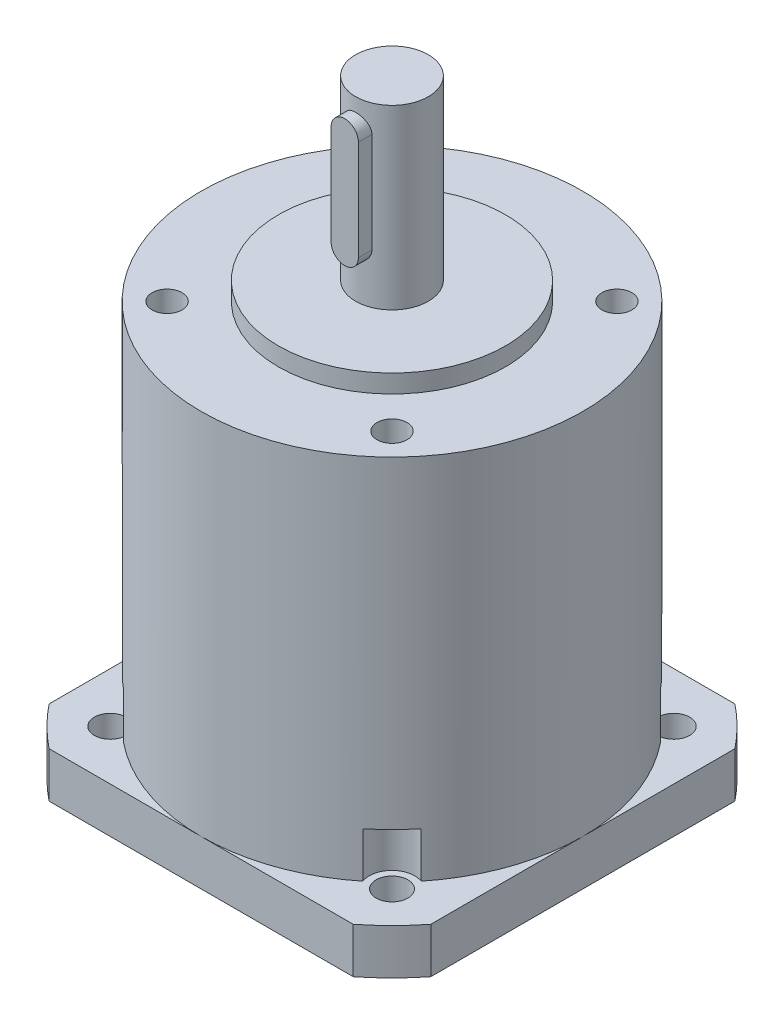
from build123d import *

# Parameters (mm, degrees)
SKETCH_1_R             = 21
EXTRUDE_1_DEPTH        = 40.5
SKETCH_2_R             = 12.5
EXTRUDE_2_DEPTH        = 2
SKETCH_3_R             = 4
EXTRUDE_3_DEPTH        = 21.5
HOLE_WIZARD_M4_1_D     = 3.3
HOLE_WIZARD_M4_1_DEPTH = 9
HOLE_WIZARD_M4_1_TIP   = 0.991420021
EXTRUDE_4_DEPTH        = 3
SKETCH_8_W             = 42
SKETCH_8_H             = 42
EXTRUDE_5_DEPTH        = 5
SKETCH_10_R            = 30.265542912
SKETCH_10_R_2          = 26.85
CUT_EXTRUDE_2_DEPTH    = 5.5
SKETCH_11_R            = 11
CUT_EXTRUDE_3_DEPTH    = 2.5
SKETCH_12_R            = 2.5
CUT_EXTRUDE_4_DEPTH    = 10
SKETCH_13_R            = 1.75
CUT_EXTRUDE_5_DEPTH    = 10
SKETCH_14_R            = 2.5
CUT_EXTRUDE_6_DEPTH    = 5


with BuildPart() as part:
    # Sketch 1 → Extrude 1 (new body)
    with BuildSketch(Plane(origin=(0, 0, 0), x_dir=(1, 0, 0), z_dir=(0, 1, 0))):
        with Locations(Location((0, 0, 0), (0, 0, 270))):
            Circle(SKETCH_1_R)
    extrude(amount=EXTRUDE_1_DEPTH)

    # Sketch 2 → Extrude 2 (add)
    with BuildSketch(Plane(origin=(0, 40.5, 0), x_dir=(1, 0, 0), z_dir=(0, 1, 0))):
        with Locations(Location((0, 0, 0), (0, 0, 270))):
            Circle(SKETCH_2_R)
    extrude(amount=EXTRUDE_2_DEPTH)

    # Sketch 3 → Extrude 3 (add)
    with BuildSketch(Plane(origin=(0, 40.5, 0), x_dir=(1, 0, 0), z_dir=(0, 1, 0))):
        with Locations(Location((0, 0, 0), (0, 0, 270))):
            Circle(SKETCH_3_R)
    extrude(amount=EXTRUDE_3_DEPTH)

    # Hole Wizard M4 _1
    with Locations(Plane(origin=(0, 40.5, 0), x_dir=(1, 0, 0), z_dir=(0, 1, 0))):
        with Locations((-12.374368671, 12.374368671), (-12.374368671, -12.374368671), (12.374368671, -12.374368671), (12.374368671, 12.374368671)):
            Hole(HOLE_WIZARD_M4_1_D / 2, depth=HOLE_WIZARD_M4_1_DEPTH)
            with Locations((0, 0, -(HOLE_WIZARD_M4_1_DEPTH + HOLE_WIZARD_M4_1_TIP / 2))):  # 118° drill point
                Cone(0, HOLE_WIZARD_M4_1_D / 2, HOLE_WIZARD_M4_1_TIP, mode=Mode.SUBTRACT)

    # Sketch 7 → Extrude 4 (add)
    with BuildSketch(Plane.XY.offset(2.2)):
        with BuildLine():
            Line((-1.5, 59), (-1.5, 48))
            ThreePointArc((-1.5, 48), (0, 46.5), (1.5, 48))
            Line((1.5, 48), (1.5, 59))
            ThreePointArc((1.5, 59), (0, 60.5), (-1.5, 59))
        make_face()
    extrude(amount=EXTRUDE_4_DEPTH)

    # Sketch 8 → Extrude 5 (add)
    with BuildSketch(Plane(origin=(0, 0, 0), x_dir=(1, 0, 0), z_dir=(0, 1, 0))):
        Rectangle(SKETCH_8_W, SKETCH_8_H)
    extrude(amount=-EXTRUDE_5_DEPTH)

    # Sketch 10 → Cut-Extrude 2 (cut)
    with BuildSketch(Plane(origin=(0, 0, 0), x_dir=(1, 0, 0), z_dir=(0, 1, 0))):
        Circle(SKETCH_10_R)
        Circle(SKETCH_10_R_2, mode=Mode.SUBTRACT)
    extrude(amount=-CUT_EXTRUDE_2_DEPTH, mode=Mode.SUBTRACT)

    # Sketch 11 → Cut-Extrude 3 (cut)
    with BuildSketch(Plane(origin=(0, -5, 0), x_dir=(-1, 0, 0), z_dir=(0, -1, 0))):
        with Locations(Location((0, 0, 0), (0, 0, 90))):
            Circle(SKETCH_11_R)
    extrude(amount=-CUT_EXTRUDE_3_DEPTH, mode=Mode.SUBTRACT)

    # Sketch 12 → Cut-Extrude 4 (cut)
    with BuildSketch(Plane(origin=(0, -5, 0), x_dir=(-1, 0, 0), z_dir=(0, -1, 0))):
        with Locations(Location((0, 0, 0), (0, 0, 90))):
            Circle(SKETCH_12_R)
    extrude(amount=-CUT_EXTRUDE_4_DEPTH, mode=Mode.SUBTRACT)

    # Sketch 13 → Cut-Extrude 5 (cut)
    with BuildSketch(Plane(origin=(0, -5, 0), x_dir=(-1, 0, 0), z_dir=(0, -1, 0))):
        with Locations(Location((-15.5, -15.5, 0), (0, 0, 90))):
            Circle(SKETCH_13_R)
        with Locations(Location((-15.5, 15.5, 0), (0, 0, 90))):
            Circle(SKETCH_13_R)
        with Locations(Location((15.5, 15.5, 0), (0, 0, 90))):
            Circle(SKETCH_13_R)
        with Locations(Location((15.5, -15.5, 0), (0, 0, 90))):
            Circle(SKETCH_13_R)
    extrude(amount=-CUT_EXTRUDE_5_DEPTH, mode=Mode.SUBTRACT)

    # Sketch 14 → Cut-Extrude 6 (cut)
    with BuildSketch(Plane(origin=(0, 0, 0), x_dir=(1, 0, 0), z_dir=(0, 1, 0))):
        with Locations((15.5, -15.5)):
            Circle(SKETCH_14_R)
        with Locations((-15.5, -15.5)):
            Circle(SKETCH_14_R)
        with Locations((-15.5, 15.5)):
            Circle(SKETCH_14_R)
        with Locations((15.5, 15.5)):
            Circle(SKETCH_14_R)
    extrude(amount=CUT_EXTRUDE_6_DEPTH, mode=Mode.SUBTRACT)


solid = part.part
